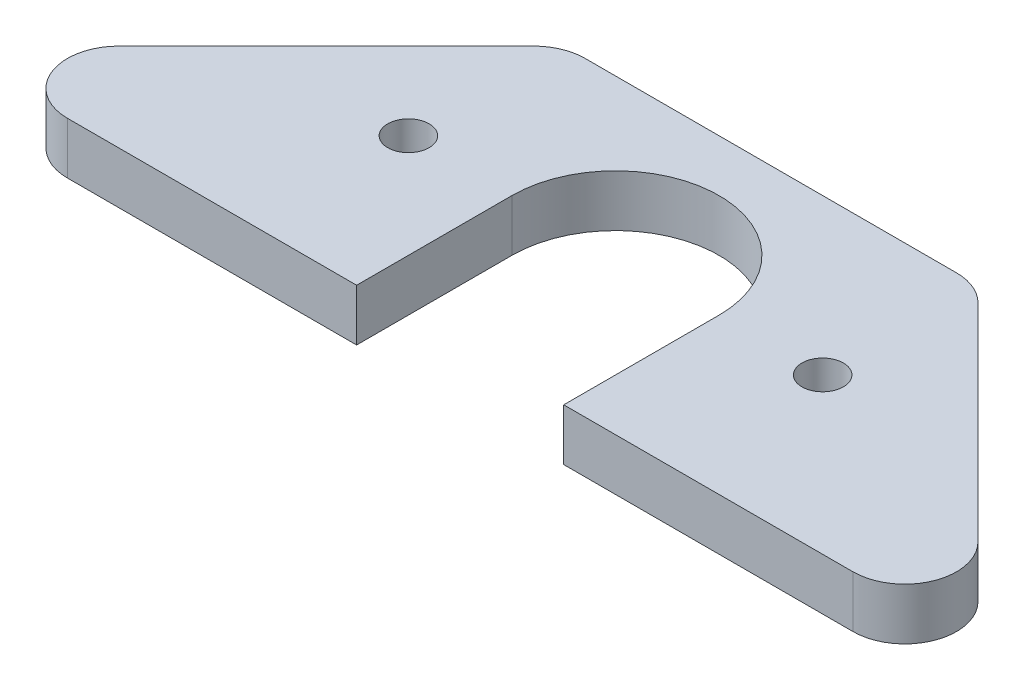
ISO-10303-21;
HEADER;
FILE_DESCRIPTION(('STEP AP214'),'2;1');
FILE_NAME('part.step','',(''),(''),'','','');
FILE_SCHEMA(('AUTOMOTIVE_DESIGN { 1 0 10303 214 1 1 1 1 }'));
ENDSEC;
DATA;
#1=APPLICATION_CONTEXT('core data for automotive mechanical design processes');
#2=APPLICATION_PROTOCOL_DEFINITION('international standard','automotive_design',2000,#1);
#3=PRODUCT_CONTEXT('',#1,'mechanical');
#4=PRODUCT('Part','Part','',(#3));
#5=PRODUCT_RELATED_PRODUCT_CATEGORY('part','',(#4));
#6=PRODUCT_DEFINITION_FORMATION('','',#4);
#7=PRODUCT_DEFINITION_CONTEXT('part definition',#1,'design');
#8=PRODUCT_DEFINITION('design','',#6,#7);
#9=PRODUCT_DEFINITION_SHAPE('','',#8);
#10=(LENGTH_UNIT() NAMED_UNIT(*) SI_UNIT(.MILLI.,.METRE.));
#11=(NAMED_UNIT(*) PLANE_ANGLE_UNIT() SI_UNIT($,.RADIAN.));
#12=(NAMED_UNIT(*) SI_UNIT($,.STERADIAN.) SOLID_ANGLE_UNIT());
#13=UNCERTAINTY_MEASURE_WITH_UNIT(LENGTH_MEASURE(1.E-05),#10,'distance_accuracy_value','');
#14=(GEOMETRIC_REPRESENTATION_CONTEXT(3) GLOBAL_UNCERTAINTY_ASSIGNED_CONTEXT((#13)) GLOBAL_UNIT_ASSIGNED_CONTEXT((#10,
#11,#12)) REPRESENTATION_CONTEXT('',''));
#15=CARTESIAN_POINT('',(0.,0.,0.));
#16=DIRECTION('',(0.,0.,1.));
#17=DIRECTION('',(1.,0.,0.));
#18=AXIS2_PLACEMENT_3D('',#15,#16,#17);
#19=CARTESIAN_POINT('',(0.,5.,0.));
#20=DIRECTION('',(0.,1.,0.));
#21=DIRECTION('',(0.,0.,1.));
#22=AXIS2_PLACEMENT_3D('',#19,#20,#21);
#23=PLANE('',#22);
#24=CARTESIAN_POINT('',(-20.,5.,0.));
#25=DIRECTION('',(0.,1.,0.));
#26=DIRECTION('',(0.,0.,1.));
#27=AXIS2_PLACEMENT_3D('',#24,#25,#26);
#28=CIRCLE('',#27,2.);
#29=CARTESIAN_POINT('',(-20.,5.,2.));
#30=VERTEX_POINT('',#29);
#31=EDGE_CURVE('E237',#30,#30,#28,.T.);
#32=ORIENTED_EDGE('',*,*,#31,.F.);
#33=EDGE_LOOP('',(#32));
#34=FACE_BOUND('',#33,.T.);
#35=DIRECTION('',(-0.707106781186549,0.,-0.707106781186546));
#36=VECTOR('',#35,1.);
#37=CARTESIAN_POINT('',(50.0000000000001,5.,15.));
#38=LINE('',#37,#36);
#39=CARTESIAN_POINT('',(41.4644660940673,5.,6.46446609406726));
#40=VERTEX_POINT('',#39);
#41=CARTESIAN_POINT('',(21.4644660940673,5.,-13.5355339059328));
#42=VERTEX_POINT('',#41);
#43=EDGE_CURVE('E202',#40,#42,#38,.T.);
#44=ORIENTED_EDGE('',*,*,#43,.T.);
#45=CARTESIAN_POINT('',(17.9289321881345,5.,-10.));
#46=DIRECTION('',(0.,1.,0.));
#47=DIRECTION('',(0.,0.,1.));
#48=AXIS2_PLACEMENT_3D('',#45,#46,#47);
#49=CIRCLE('',#48,5.);
#50=CARTESIAN_POINT('',(17.9289321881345,5.,-15.));
#51=VERTEX_POINT('',#50);
#52=EDGE_CURVE('E188',#42,#51,#49,.T.);
#53=ORIENTED_EDGE('',*,*,#52,.T.);
#54=DIRECTION('',(-1.,0.,0.));
#55=VECTOR('',#54,1.);
#56=CARTESIAN_POINT('',(-20.,5.,-15.));
#57=LINE('',#56,#55);
#58=CARTESIAN_POINT('',(-17.9289321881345,5.,-15.));
#59=VERTEX_POINT('',#58);
#60=EDGE_CURVE('E248',#51,#59,#57,.T.);
#61=ORIENTED_EDGE('',*,*,#60,.T.);
#62=CARTESIAN_POINT('',(-17.9289321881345,5.,-10.));
#63=DIRECTION('',(0.,1.,0.));
#64=DIRECTION('',(0.,0.,1.));
#65=AXIS2_PLACEMENT_3D('',#62,#63,#64);
#66=CIRCLE('',#65,5.);
#67=CARTESIAN_POINT('',(-21.4644660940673,5.,-13.5355339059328));
#68=VERTEX_POINT('',#67);
#69=EDGE_CURVE('E186',#59,#68,#66,.T.);
#70=ORIENTED_EDGE('',*,*,#69,.T.);
#71=DIRECTION('',(-0.707106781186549,0.,0.707106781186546));
#72=VECTOR('',#71,1.);
#73=CARTESIAN_POINT('',(-50.0000000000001,5.,15.));
#74=LINE('',#73,#72);
#75=CARTESIAN_POINT('',(-41.4644660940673,5.,6.46446609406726));
#76=VERTEX_POINT('',#75);
#77=EDGE_CURVE('E246',#68,#76,#74,.T.);
#78=ORIENTED_EDGE('',*,*,#77,.T.);
#79=CARTESIAN_POINT('',(-37.9289321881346,5.,10.));
#80=DIRECTION('',(0.,1.,0.));
#81=DIRECTION('',(0.,0.,1.));
#82=AXIS2_PLACEMENT_3D('',#79,#80,#81);
#83=CIRCLE('',#82,5.);
#84=CARTESIAN_POINT('',(-37.9289321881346,5.,15.));
#85=VERTEX_POINT('',#84);
#86=EDGE_CURVE('E58',#76,#85,#83,.T.);
#87=ORIENTED_EDGE('',*,*,#86,.T.);
#88=DIRECTION('',(1.,0.,0.));
#89=VECTOR('',#88,1.);
#90=CARTESIAN_POINT('',(-10.,5.,15.));
#91=LINE('',#90,#89);
#92=CARTESIAN_POINT('',(-10.,5.,15.));
#93=VERTEX_POINT('',#92);
#94=EDGE_CURVE('E244',#85,#93,#91,.T.);
#95=ORIENTED_EDGE('',*,*,#94,.T.);
#96=DIRECTION('',(0.,0.,-1.));
#97=VECTOR('',#96,1.);
#98=CARTESIAN_POINT('',(-10.,5.,0.));
#99=LINE('',#98,#97);
#100=CARTESIAN_POINT('',(-10.,5.,0.));
#101=VERTEX_POINT('',#100);
#102=EDGE_CURVE('E151',#93,#101,#99,.T.);
#103=ORIENTED_EDGE('',*,*,#102,.T.);
#104=CARTESIAN_POINT('',(0.,5.,0.));
#105=DIRECTION('',(0.,-1.,0.));
#106=DIRECTION('',(0.,0.,1.));
#107=AXIS2_PLACEMENT_3D('',#104,#105,#106);
#108=CIRCLE('',#107,10.);
#109=CARTESIAN_POINT('',(10.,5.,0.));
#110=VERTEX_POINT('',#109);
#111=EDGE_CURVE('E145',#101,#110,#108,.T.);
#112=ORIENTED_EDGE('',*,*,#111,.T.);
#113=DIRECTION('',(0.,0.,1.));
#114=VECTOR('',#113,1.);
#115=CARTESIAN_POINT('',(10.,5.,0.));
#116=LINE('',#115,#114);
#117=CARTESIAN_POINT('',(10.,5.,15.));
#118=VERTEX_POINT('',#117);
#119=EDGE_CURVE('E134',#110,#118,#116,.T.);
#120=ORIENTED_EDGE('',*,*,#119,.T.);
#121=DIRECTION('',(1.,0.,0.));
#122=VECTOR('',#121,1.);
#123=CARTESIAN_POINT('',(10.,5.,15.));
#124=LINE('',#123,#122);
#125=CARTESIAN_POINT('',(37.9289321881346,5.,15.));
#126=VERTEX_POINT('',#125);
#127=EDGE_CURVE('E144',#118,#126,#124,.T.);
#128=ORIENTED_EDGE('',*,*,#127,.T.);
#129=CARTESIAN_POINT('',(37.9289321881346,5.,10.));
#130=DIRECTION('',(0.,1.,0.));
#131=DIRECTION('',(0.,0.,1.));
#132=AXIS2_PLACEMENT_3D('',#129,#130,#131);
#133=CIRCLE('',#132,5.);
#134=EDGE_CURVE('E184',#126,#40,#133,.T.);
#135=ORIENTED_EDGE('',*,*,#134,.T.);
#136=EDGE_LOOP('',(#44,#53,#61,#70,#78,#87,#95,#103,#112,#120,#128,#135));
#137=FACE_BOUND('',#136,.T.);
#138=CARTESIAN_POINT('',(20.,5.,-2.22044604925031E-13));
#139=DIRECTION('',(0.,1.,0.));
#140=DIRECTION('',(0.,0.,-1.));
#141=AXIS2_PLACEMENT_3D('',#138,#139,#140);
#142=CIRCLE('',#141,2.);
#143=CARTESIAN_POINT('',(20.,5.,-2.00000000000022));
#144=VERTEX_POINT('',#143);
#145=EDGE_CURVE('E253',#144,#144,#142,.T.);
#146=ORIENTED_EDGE('',*,*,#145,.F.);
#147=EDGE_LOOP('',(#146));
#148=FACE_BOUND('',#147,.T.);
#149=ADVANCED_FACE('F43',(#34,#137,#148),#23,.T.);
#150=CARTESIAN_POINT('',(0.,0.,0.));
#151=DIRECTION('',(0.,1.,0.));
#152=DIRECTION('',(0.,0.,1.));
#153=AXIS2_PLACEMENT_3D('',#150,#151,#152);
#154=PLANE('',#153);
#155=DIRECTION('',(-1.,0.,0.));
#156=VECTOR('',#155,1.);
#157=CARTESIAN_POINT('',(-20.,0.,-15.));
#158=LINE('',#157,#156);
#159=CARTESIAN_POINT('',(17.9289321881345,0.,-15.));
#160=VERTEX_POINT('',#159);
#161=CARTESIAN_POINT('',(-17.9289321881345,0.,-15.));
#162=VERTEX_POINT('',#161);
#163=EDGE_CURVE('E216',#160,#162,#158,.T.);
#164=ORIENTED_EDGE('',*,*,#163,.F.);
#165=CARTESIAN_POINT('',(17.9289321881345,0.,-10.));
#166=DIRECTION('',(0.,1.,0.));
#167=DIRECTION('',(0.,0.,1.));
#168=AXIS2_PLACEMENT_3D('',#165,#166,#167);
#169=CIRCLE('',#168,5.);
#170=CARTESIAN_POINT('',(21.4644660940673,0.,-13.5355339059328));
#171=VERTEX_POINT('',#170);
#172=EDGE_CURVE('E176',#160,#171,#169,.F.);
#173=ORIENTED_EDGE('',*,*,#172,.T.);
#174=DIRECTION('',(-0.707106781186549,0.,-0.707106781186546));
#175=VECTOR('',#174,1.);
#176=CARTESIAN_POINT('',(50.0000000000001,0.,15.));
#177=LINE('',#176,#175);
#178=CARTESIAN_POINT('',(41.4644660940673,0.,6.46446609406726));
#179=VERTEX_POINT('',#178);
#180=EDGE_CURVE('E210',#179,#171,#177,.T.);
#181=ORIENTED_EDGE('',*,*,#180,.F.);
#182=CARTESIAN_POINT('',(37.9289321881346,0.,10.));
#183=DIRECTION('',(0.,1.,0.));
#184=DIRECTION('',(0.,0.,1.));
#185=AXIS2_PLACEMENT_3D('',#182,#183,#184);
#186=CIRCLE('',#185,5.);
#187=CARTESIAN_POINT('',(37.9289321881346,0.,15.));
#188=VERTEX_POINT('',#187);
#189=EDGE_CURVE('E172',#179,#188,#186,.F.);
#190=ORIENTED_EDGE('',*,*,#189,.T.);
#191=DIRECTION('',(1.,0.,0.));
#192=VECTOR('',#191,1.);
#193=CARTESIAN_POINT('',(10.,0.,15.));
#194=LINE('',#193,#192);
#195=CARTESIAN_POINT('',(10.,0.,15.));
#196=VERTEX_POINT('',#195);
#197=EDGE_CURVE('E198',#196,#188,#194,.T.);
#198=ORIENTED_EDGE('',*,*,#197,.F.);
#199=DIRECTION('',(0.,0.,1.));
#200=VECTOR('',#199,1.);
#201=CARTESIAN_POINT('',(10.,0.,0.));
#202=LINE('',#201,#200);
#203=CARTESIAN_POINT('',(10.,0.,0.));
#204=VERTEX_POINT('',#203);
#205=EDGE_CURVE('E221',#204,#196,#202,.T.);
#206=ORIENTED_EDGE('',*,*,#205,.F.);
#207=CARTESIAN_POINT('',(0.,0.,0.));
#208=DIRECTION('',(0.,-1.,0.));
#209=DIRECTION('',(0.,0.,1.));
#210=AXIS2_PLACEMENT_3D('',#207,#208,#209);
#211=CIRCLE('',#210,10.);
#212=CARTESIAN_POINT('',(-10.,0.,0.));
#213=VERTEX_POINT('',#212);
#214=EDGE_CURVE('E159',#213,#204,#211,.T.);
#215=ORIENTED_EDGE('',*,*,#214,.F.);
#216=DIRECTION('',(0.,0.,-1.));
#217=VECTOR('',#216,1.);
#218=CARTESIAN_POINT('',(-10.,0.,0.));
#219=LINE('',#218,#217);
#220=CARTESIAN_POINT('',(-10.,0.,15.));
#221=VERTEX_POINT('',#220);
#222=EDGE_CURVE('E155',#221,#213,#219,.T.);
#223=ORIENTED_EDGE('',*,*,#222,.F.);
#224=DIRECTION('',(1.,0.,0.));
#225=VECTOR('',#224,1.);
#226=CARTESIAN_POINT('',(-10.,0.,15.));
#227=LINE('',#226,#225);
#228=CARTESIAN_POINT('',(-37.9289321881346,0.,15.));
#229=VERTEX_POINT('',#228);
#230=EDGE_CURVE('E226',#229,#221,#227,.T.);
#231=ORIENTED_EDGE('',*,*,#230,.F.);
#232=CARTESIAN_POINT('',(-37.9289321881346,0.,10.));
#233=DIRECTION('',(0.,1.,0.));
#234=DIRECTION('',(0.,0.,1.));
#235=AXIS2_PLACEMENT_3D('',#232,#233,#234);
#236=CIRCLE('',#235,5.);
#237=CARTESIAN_POINT('',(-41.4644660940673,0.,6.46446609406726));
#238=VERTEX_POINT('',#237);
#239=EDGE_CURVE('E170',#229,#238,#236,.F.);
#240=ORIENTED_EDGE('',*,*,#239,.T.);
#241=DIRECTION('',(-0.707106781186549,0.,0.707106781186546));
#242=VECTOR('',#241,1.);
#243=CARTESIAN_POINT('',(-50.0000000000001,0.,15.));
#244=LINE('',#243,#242);
#245=CARTESIAN_POINT('',(-21.4644660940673,0.,-13.5355339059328));
#246=VERTEX_POINT('',#245);
#247=EDGE_CURVE('E219',#246,#238,#244,.T.);
#248=ORIENTED_EDGE('',*,*,#247,.F.);
#249=CARTESIAN_POINT('',(-17.9289321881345,0.,-10.));
#250=DIRECTION('',(0.,1.,0.));
#251=DIRECTION('',(0.,0.,1.));
#252=AXIS2_PLACEMENT_3D('',#249,#250,#251);
#253=CIRCLE('',#252,5.);
#254=EDGE_CURVE('E174',#246,#162,#253,.F.);
#255=ORIENTED_EDGE('',*,*,#254,.T.);
#256=EDGE_LOOP('',(#164,#173,#181,#190,#198,#206,#215,#223,#231,#240,#248,#255));
#257=FACE_BOUND('',#256,.T.);
#258=CARTESIAN_POINT('',(-20.,0.,0.));
#259=DIRECTION('',(0.,1.,0.));
#260=DIRECTION('',(0.,0.,1.));
#261=AXIS2_PLACEMENT_3D('',#258,#259,#260);
#262=CIRCLE('',#261,2.);
#263=CARTESIAN_POINT('',(-20.,0.,2.));
#264=VERTEX_POINT('',#263);
#265=EDGE_CURVE('E240',#264,#264,#262,.T.);
#266=ORIENTED_EDGE('',*,*,#265,.T.);
#267=EDGE_LOOP('',(#266));
#268=FACE_BOUND('',#267,.T.);
#269=CARTESIAN_POINT('',(20.,0.,-2.22044604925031E-13));
#270=DIRECTION('',(0.,1.,0.));
#271=DIRECTION('',(0.,0.,-1.));
#272=AXIS2_PLACEMENT_3D('',#269,#270,#271);
#273=CIRCLE('',#272,2.);
#274=CARTESIAN_POINT('',(20.,0.,-2.00000000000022));
#275=VERTEX_POINT('',#274);
#276=EDGE_CURVE('E255',#275,#275,#273,.T.);
#277=ORIENTED_EDGE('',*,*,#276,.T.);
#278=EDGE_LOOP('',(#277));
#279=FACE_BOUND('',#278,.T.);
#280=ADVANCED_FACE('F214',(#257,#268,#279),#154,.F.);
#281=CARTESIAN_POINT('',(0.,5.,0.));
#282=DIRECTION('',(0.,-1.,0.));
#283=DIRECTION('',(0.,0.,-1.));
#284=AXIS2_PLACEMENT_3D('',#281,#282,#283);
#285=CYLINDRICAL_SURFACE('',#284,10.);
#286=ORIENTED_EDGE('',*,*,#214,.T.);
#287=DIRECTION('',(0.,-1.,0.));
#288=VECTOR('',#287,1.);
#289=CARTESIAN_POINT('',(10.,5.,0.));
#290=LINE('',#289,#288);
#291=EDGE_CURVE('E138',#110,#204,#290,.T.);
#292=ORIENTED_EDGE('',*,*,#291,.F.);
#293=ORIENTED_EDGE('',*,*,#111,.F.);
#294=DIRECTION('',(0.,-1.,0.));
#295=VECTOR('',#294,1.);
#296=CARTESIAN_POINT('',(-10.,5.,0.));
#297=LINE('',#296,#295);
#298=EDGE_CURVE('E229',#101,#213,#297,.T.);
#299=ORIENTED_EDGE('',*,*,#298,.T.);
#300=EDGE_LOOP('',(#286,#292,#293,#299));
#301=FACE_BOUND('',#300,.T.);
#302=ADVANCED_FACE('F157',(#301),#285,.F.);
#303=CARTESIAN_POINT('',(10.,5.,0.));
#304=DIRECTION('',(1.,0.,0.));
#305=DIRECTION('',(0.,0.,-1.));
#306=AXIS2_PLACEMENT_3D('',#303,#304,#305);
#307=PLANE('',#306);
#308=ORIENTED_EDGE('',*,*,#205,.T.);
#309=DIRECTION('',(0.,-1.,0.));
#310=VECTOR('',#309,1.);
#311=CARTESIAN_POINT('',(10.,5.,15.));
#312=LINE('',#311,#310);
#313=EDGE_CURVE('E141',#118,#196,#312,.T.);
#314=ORIENTED_EDGE('',*,*,#313,.F.);
#315=ORIENTED_EDGE('',*,*,#119,.F.);
#316=ORIENTED_EDGE('',*,*,#291,.T.);
#317=EDGE_LOOP('',(#308,#314,#315,#316));
#318=FACE_BOUND('',#317,.T.);
#319=ADVANCED_FACE('F136',(#318),#307,.F.);
#320=CARTESIAN_POINT('',(10.,5.,15.));
#321=DIRECTION('',(0.,0.,-1.));
#322=DIRECTION('',(-1.,0.,0.));
#323=AXIS2_PLACEMENT_3D('',#320,#321,#322);
#324=PLANE('',#323);
#325=ORIENTED_EDGE('',*,*,#197,.T.);
#326=DIRECTION('',(0.,-1.,0.));
#327=VECTOR('',#326,1.);
#328=CARTESIAN_POINT('',(37.9289321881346,5.,15.));
#329=LINE('',#328,#327);
#330=EDGE_CURVE('E51',#188,#126,#329,.F.);
#331=ORIENTED_EDGE('',*,*,#330,.T.);
#332=ORIENTED_EDGE('',*,*,#127,.F.);
#333=ORIENTED_EDGE('',*,*,#313,.T.);
#334=EDGE_LOOP('',(#325,#331,#332,#333));
#335=FACE_BOUND('',#334,.T.);
#336=ADVANCED_FACE('F196',(#335),#324,.F.);
#337=CARTESIAN_POINT('',(50.0000000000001,5.,15.));
#338=DIRECTION('',(-0.707106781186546,0.,0.707106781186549));
#339=DIRECTION('',(0.707106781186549,0.,0.707106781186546));
#340=AXIS2_PLACEMENT_3D('',#337,#338,#339);
#341=PLANE('',#340);
#342=ORIENTED_EDGE('',*,*,#180,.T.);
#343=DIRECTION('',(0.,-1.,0.));
#344=VECTOR('',#343,1.);
#345=CARTESIAN_POINT('',(21.4644660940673,5.,-13.5355339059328));
#346=LINE('',#345,#344);
#347=EDGE_CURVE('E181',#171,#42,#346,.F.);
#348=ORIENTED_EDGE('',*,*,#347,.T.);
#349=ORIENTED_EDGE('',*,*,#43,.F.);
#350=DIRECTION('',(0.,-1.,0.));
#351=VECTOR('',#350,1.);
#352=CARTESIAN_POINT('',(41.4644660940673,5.,6.46446609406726));
#353=LINE('',#352,#351);
#354=EDGE_CURVE('E178',#40,#179,#353,.T.);
#355=ORIENTED_EDGE('',*,*,#354,.T.);
#356=EDGE_LOOP('',(#342,#348,#349,#355));
#357=FACE_BOUND('',#356,.T.);
#358=ADVANCED_FACE('F209',(#357),#341,.F.);
#359=CARTESIAN_POINT('',(-20.,5.,-15.));
#360=DIRECTION('',(0.,0.,1.));
#361=DIRECTION('',(1.,0.,0.));
#362=AXIS2_PLACEMENT_3D('',#359,#360,#361);
#363=PLANE('',#362);
#364=ORIENTED_EDGE('',*,*,#60,.F.);
#365=DIRECTION('',(0.,-1.,0.));
#366=VECTOR('',#365,1.);
#367=CARTESIAN_POINT('',(17.9289321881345,5.,-15.));
#368=LINE('',#367,#366);
#369=EDGE_CURVE('E162',#51,#160,#368,.T.);
#370=ORIENTED_EDGE('',*,*,#369,.T.);
#371=ORIENTED_EDGE('',*,*,#163,.T.);
#372=DIRECTION('',(0.,-1.,0.));
#373=VECTOR('',#372,1.);
#374=CARTESIAN_POINT('',(-17.9289321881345,5.,-15.));
#375=LINE('',#374,#373);
#376=EDGE_CURVE('E160',#162,#59,#375,.F.);
#377=ORIENTED_EDGE('',*,*,#376,.T.);
#378=EDGE_LOOP('',(#364,#370,#371,#377));
#379=FACE_BOUND('',#378,.T.);
#380=ADVANCED_FACE('F284',(#379),#363,.F.);
#381=CARTESIAN_POINT('',(-50.0000000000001,5.,15.));
#382=DIRECTION('',(0.707106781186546,0.,0.707106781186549));
#383=DIRECTION('',(0.707106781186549,0.,-0.707106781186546));
#384=AXIS2_PLACEMENT_3D('',#381,#382,#383);
#385=PLANE('',#384);
#386=ORIENTED_EDGE('',*,*,#77,.F.);
#387=DIRECTION('',(0.,-1.,0.));
#388=VECTOR('',#387,1.);
#389=CARTESIAN_POINT('',(-21.4644660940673,5.,-13.5355339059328));
#390=LINE('',#389,#388);
#391=EDGE_CURVE('E191',#68,#246,#390,.T.);
#392=ORIENTED_EDGE('',*,*,#391,.T.);
#393=ORIENTED_EDGE('',*,*,#247,.T.);
#394=DIRECTION('',(0.,-1.,0.));
#395=VECTOR('',#394,1.);
#396=CARTESIAN_POINT('',(-41.4644660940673,5.,6.46446609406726));
#397=LINE('',#396,#395);
#398=EDGE_CURVE('E66',#238,#76,#397,.F.);
#399=ORIENTED_EDGE('',*,*,#398,.T.);
#400=EDGE_LOOP('',(#386,#392,#393,#399));
#401=FACE_BOUND('',#400,.T.);
#402=ADVANCED_FACE('F281',(#401),#385,.F.);
#403=CARTESIAN_POINT('',(-10.,5.,15.));
#404=DIRECTION('',(0.,0.,-1.));
#405=DIRECTION('',(-1.,0.,0.));
#406=AXIS2_PLACEMENT_3D('',#403,#404,#405);
#407=PLANE('',#406);
#408=ORIENTED_EDGE('',*,*,#94,.F.);
#409=DIRECTION('',(0.,-1.,0.));
#410=VECTOR('',#409,1.);
#411=CARTESIAN_POINT('',(-37.9289321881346,5.,15.));
#412=LINE('',#411,#410);
#413=EDGE_CURVE('E11',#85,#229,#412,.T.);
#414=ORIENTED_EDGE('',*,*,#413,.T.);
#415=ORIENTED_EDGE('',*,*,#230,.T.);
#416=DIRECTION('',(0.,-1.,0.));
#417=VECTOR('',#416,1.);
#418=CARTESIAN_POINT('',(-10.,5.,15.));
#419=LINE('',#418,#417);
#420=EDGE_CURVE('E164',#93,#221,#419,.T.);
#421=ORIENTED_EDGE('',*,*,#420,.F.);
#422=EDGE_LOOP('',(#408,#414,#415,#421));
#423=FACE_BOUND('',#422,.T.);
#424=ADVANCED_FACE('F278',(#423),#407,.F.);
#425=CARTESIAN_POINT('',(-10.,5.,0.));
#426=DIRECTION('',(-1.,0.,0.));
#427=DIRECTION('',(0.,0.,1.));
#428=AXIS2_PLACEMENT_3D('',#425,#426,#427);
#429=PLANE('',#428);
#430=ORIENTED_EDGE('',*,*,#222,.T.);
#431=ORIENTED_EDGE('',*,*,#298,.F.);
#432=ORIENTED_EDGE('',*,*,#102,.F.);
#433=ORIENTED_EDGE('',*,*,#420,.T.);
#434=EDGE_LOOP('',(#430,#431,#432,#433));
#435=FACE_BOUND('',#434,.T.);
#436=ADVANCED_FACE('F234',(#435),#429,.F.);
#437=CARTESIAN_POINT('',(-20.,5.,0.));
#438=DIRECTION('',(0.,-1.,0.));
#439=DIRECTION('',(0.,0.,-1.));
#440=AXIS2_PLACEMENT_3D('',#437,#438,#439);
#441=CYLINDRICAL_SURFACE('',#440,2.);
#442=ORIENTED_EDGE('',*,*,#31,.T.);
#443=EDGE_LOOP('',(#442));
#444=FACE_BOUND('',#443,.T.);
#445=ORIENTED_EDGE('',*,*,#265,.F.);
#446=EDGE_LOOP('',(#445));
#447=FACE_BOUND('',#446,.T.);
#448=ADVANCED_FACE('F273',(#444,#447),#441,.F.);
#449=CARTESIAN_POINT('',(20.,5.,-2.22044604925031E-13));
#450=DIRECTION('',(0.,-1.,0.));
#451=DIRECTION('',(0.,0.,-1.));
#452=AXIS2_PLACEMENT_3D('',#449,#450,#451);
#453=CYLINDRICAL_SURFACE('',#452,2.);
#454=ORIENTED_EDGE('',*,*,#145,.T.);
#455=EDGE_LOOP('',(#454));
#456=FACE_BOUND('',#455,.T.);
#457=ORIENTED_EDGE('',*,*,#276,.F.);
#458=EDGE_LOOP('',(#457));
#459=FACE_BOUND('',#458,.T.);
#460=ADVANCED_FACE('F261',(#456,#459),#453,.F.);
#461=CARTESIAN_POINT('',(17.9289321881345,5.,-10.));
#462=DIRECTION('',(0.,-1.,0.));
#463=DIRECTION('',(0.,0.,-1.));
#464=AXIS2_PLACEMENT_3D('',#461,#462,#463);
#465=CYLINDRICAL_SURFACE('',#464,5.);
#466=ORIENTED_EDGE('',*,*,#52,.F.);
#467=ORIENTED_EDGE('',*,*,#347,.F.);
#468=ORIENTED_EDGE('',*,*,#172,.F.);
#469=ORIENTED_EDGE('',*,*,#369,.F.);
#470=EDGE_LOOP('',(#466,#467,#468,#469));
#471=FACE_BOUND('',#470,.T.);
#472=ADVANCED_FACE('F296',(#471),#465,.T.);
#473=CARTESIAN_POINT('',(-17.9289321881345,5.,-10.));
#474=DIRECTION('',(0.,-1.,0.));
#475=DIRECTION('',(0.,0.,-1.));
#476=AXIS2_PLACEMENT_3D('',#473,#474,#475);
#477=CYLINDRICAL_SURFACE('',#476,5.);
#478=ORIENTED_EDGE('',*,*,#69,.F.);
#479=ORIENTED_EDGE('',*,*,#376,.F.);
#480=ORIENTED_EDGE('',*,*,#254,.F.);
#481=ORIENTED_EDGE('',*,*,#391,.F.);
#482=EDGE_LOOP('',(#478,#479,#480,#481));
#483=FACE_BOUND('',#482,.T.);
#484=ADVANCED_FACE('F299',(#483),#477,.T.);
#485=CARTESIAN_POINT('',(37.9289321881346,5.,10.));
#486=DIRECTION('',(0.,-1.,0.));
#487=DIRECTION('',(0.,0.,-1.));
#488=AXIS2_PLACEMENT_3D('',#485,#486,#487);
#489=CYLINDRICAL_SURFACE('',#488,5.);
#490=ORIENTED_EDGE('',*,*,#134,.F.);
#491=ORIENTED_EDGE('',*,*,#330,.F.);
#492=ORIENTED_EDGE('',*,*,#189,.F.);
#493=ORIENTED_EDGE('',*,*,#354,.F.);
#494=EDGE_LOOP('',(#490,#491,#492,#493));
#495=FACE_BOUND('',#494,.T.);
#496=ADVANCED_FACE('F205',(#495),#489,.T.);
#497=CARTESIAN_POINT('',(-37.9289321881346,5.,10.));
#498=DIRECTION('',(0.,-1.,0.));
#499=DIRECTION('',(0.,0.,-1.));
#500=AXIS2_PLACEMENT_3D('',#497,#498,#499);
#501=CYLINDRICAL_SURFACE('',#500,5.);
#502=ORIENTED_EDGE('',*,*,#86,.F.);
#503=ORIENTED_EDGE('',*,*,#398,.F.);
#504=ORIENTED_EDGE('',*,*,#239,.F.);
#505=ORIENTED_EDGE('',*,*,#413,.F.);
#506=EDGE_LOOP('',(#502,#503,#504,#505));
#507=FACE_BOUND('',#506,.T.);
#508=ADVANCED_FACE('F45',(#507),#501,.T.);
#509=CLOSED_SHELL('',(#149,#280,#302,#319,#336,#358,#380,#402,#424,#436,#448,#460,#472,#484,
#496,#508));
#510=MANIFOLD_SOLID_BREP('B2',#509);
#511=ADVANCED_BREP_SHAPE_REPRESENTATION('',(#18,#510),#14);
#512=SHAPE_DEFINITION_REPRESENTATION(#9,#511);
ENDSEC;
END-ISO-10303-21;
